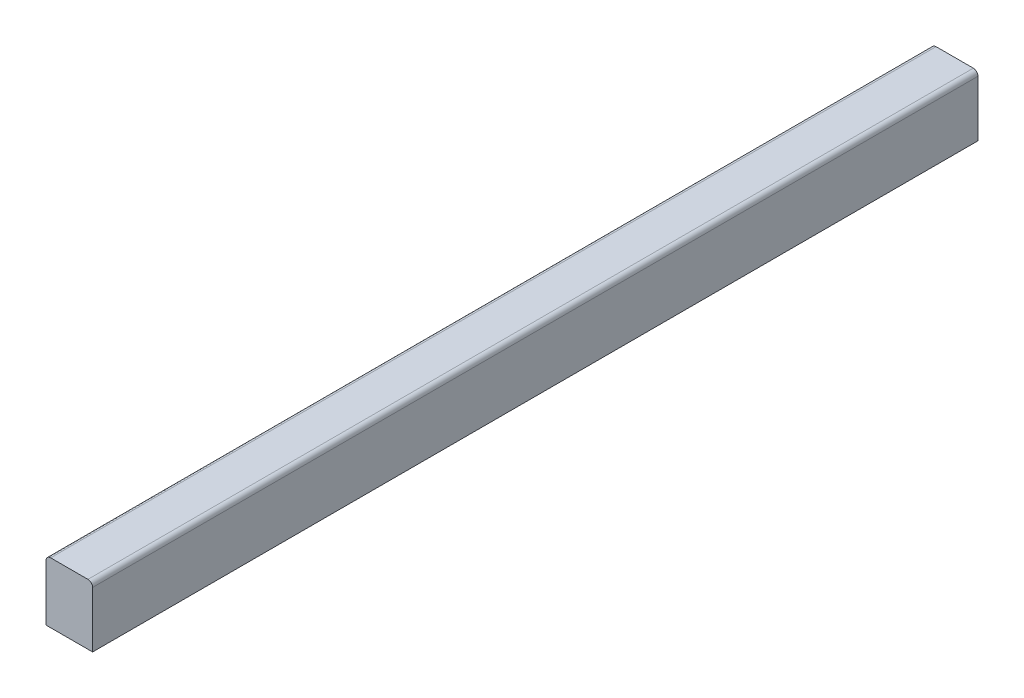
from build123d import *

# Parameters (mm, degrees)
SCHIZZO1_W                   = 10
SCHIZZO1_H                   = 13
ESTRUSIONE_ESTRUSIONE1_DEPTH = 190
RACCORDO1_R                  = 1


with BuildPart() as part:
    # Schizzo1 → Estrusione-Estrusione1 (new body)
    with BuildSketch(Plane.XY):
        Rectangle(SCHIZZO1_W, SCHIZZO1_H)
    extrude(amount=ESTRUSIONE_ESTRUSIONE1_DEPTH)

    # Raccordo1
    raccordo1_edges = [part.edges().sort_by_distance(p)[0] for p in [
        (-5, 6.5, 95),
        (5, 6.5, 95),
    ]]
    fillet(raccordo1_edges, radius=RACCORDO1_R)


solid = part.part
